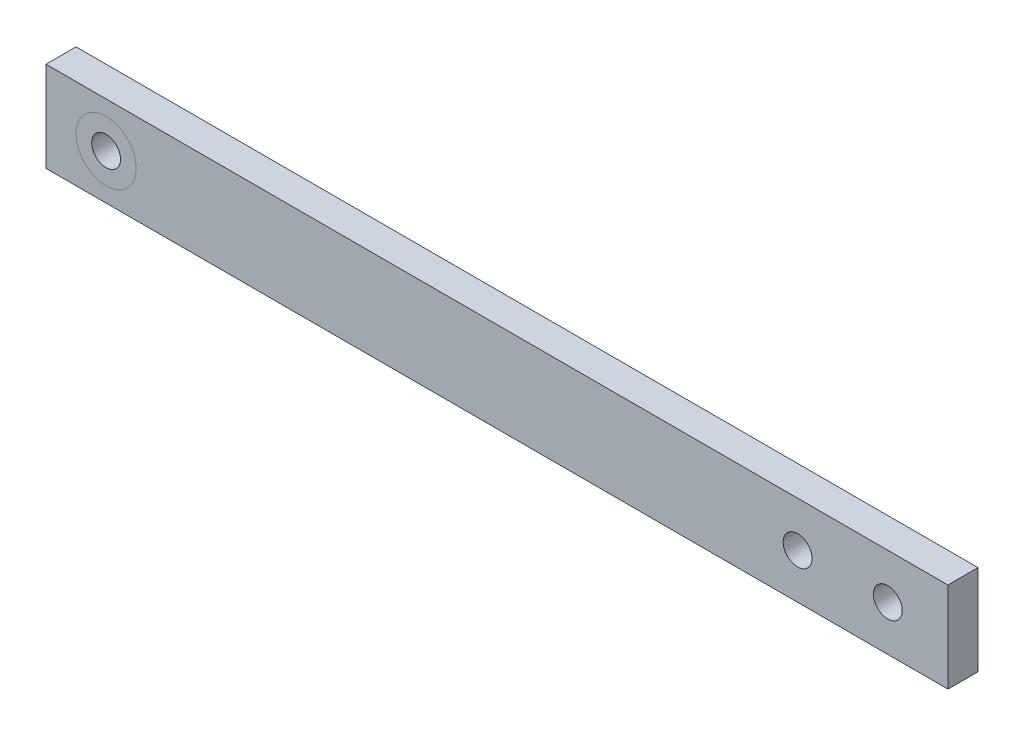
ISO-10303-21;
HEADER;
FILE_DESCRIPTION(('STEP AP214'),'2;1');
FILE_NAME('part.step','',(''),(''),'','','');
FILE_SCHEMA(('AUTOMOTIVE_DESIGN { 1 0 10303 214 1 1 1 1 }'));
ENDSEC;
DATA;
#1=APPLICATION_CONTEXT('core data for automotive mechanical design processes');
#2=APPLICATION_PROTOCOL_DEFINITION('international standard','automotive_design',2000,#1);
#3=PRODUCT_CONTEXT('',#1,'mechanical');
#4=PRODUCT('Part','Part','',(#3));
#5=PRODUCT_RELATED_PRODUCT_CATEGORY('part','',(#4));
#6=PRODUCT_DEFINITION_FORMATION('','',#4);
#7=PRODUCT_DEFINITION_CONTEXT('part definition',#1,'design');
#8=PRODUCT_DEFINITION('design','',#6,#7);
#9=PRODUCT_DEFINITION_SHAPE('','',#8);
#10=(LENGTH_UNIT() NAMED_UNIT(*) SI_UNIT(.MILLI.,.METRE.));
#11=(NAMED_UNIT(*) PLANE_ANGLE_UNIT() SI_UNIT($,.RADIAN.));
#12=(NAMED_UNIT(*) SI_UNIT($,.STERADIAN.) SOLID_ANGLE_UNIT());
#13=UNCERTAINTY_MEASURE_WITH_UNIT(LENGTH_MEASURE(1.E-05),#10,'distance_accuracy_value','');
#14=(GEOMETRIC_REPRESENTATION_CONTEXT(3) GLOBAL_UNCERTAINTY_ASSIGNED_CONTEXT((#13)) GLOBAL_UNIT_ASSIGNED_CONTEXT((#10,
#11,#12)) REPRESENTATION_CONTEXT('',''));
#15=CARTESIAN_POINT('',(0.,0.,0.));
#16=DIRECTION('',(0.,0.,1.));
#17=DIRECTION('',(1.,0.,0.));
#18=AXIS2_PLACEMENT_3D('',#15,#16,#17);
#19=CARTESIAN_POINT('',(0.,38.1,0.));
#20=DIRECTION('',(0.,0.,-1.));
#21=DIRECTION('',(-1.,0.,0.));
#22=AXIS2_PLACEMENT_3D('',#19,#20,#21);
#23=PLANE('',#22);
#24=DIRECTION('',(0.,1.,0.));
#25=VECTOR('',#24,1.);
#26=CARTESIAN_POINT('',(292.1,38.1,0.));
#27=LINE('',#26,#25);
#28=CARTESIAN_POINT('',(292.1,0.,0.));
#29=VERTEX_POINT('',#28);
#30=CARTESIAN_POINT('',(292.1,38.1,0.));
#31=VERTEX_POINT('',#30);
#32=EDGE_CURVE('E54',#29,#31,#27,.T.);
#33=ORIENTED_EDGE('',*,*,#32,.F.);
#34=DIRECTION('',(1.,0.,0.));
#35=VECTOR('',#34,1.);
#36=CARTESIAN_POINT('',(0.,0.,0.));
#37=LINE('',#36,#35);
#38=CARTESIAN_POINT('',(0.,0.,0.));
#39=VERTEX_POINT('',#38);
#40=EDGE_CURVE('E125',#39,#29,#37,.T.);
#41=ORIENTED_EDGE('',*,*,#40,.F.);
#42=DIRECTION('',(0.,-1.,0.));
#43=VECTOR('',#42,1.);
#44=CARTESIAN_POINT('',(0.,0.,0.));
#45=LINE('',#44,#43);
#46=CARTESIAN_POINT('',(0.,38.1,0.));
#47=VERTEX_POINT('',#46);
#48=EDGE_CURVE('E109',#47,#39,#45,.T.);
#49=ORIENTED_EDGE('',*,*,#48,.F.);
#50=DIRECTION('',(-1.,0.,0.));
#51=VECTOR('',#50,1.);
#52=CARTESIAN_POINT('',(0.,38.1,0.));
#53=LINE('',#52,#51);
#54=EDGE_CURVE('E122',#31,#47,#53,.T.);
#55=ORIENTED_EDGE('',*,*,#54,.F.);
#56=EDGE_LOOP('',(#33,#41,#49,#55));
#57=FACE_BOUND('',#56,.T.);
#58=CARTESIAN_POINT('',(25.4,19.05,0.));
#59=DIRECTION('',(0.,0.,-1.));
#60=DIRECTION('',(-1.,0.,0.));
#61=AXIS2_PLACEMENT_3D('',#58,#59,#60);
#62=CIRCLE('',#61,12.7);
#63=CARTESIAN_POINT('',(12.7,19.05,0.));
#64=VERTEX_POINT('',#63);
#65=EDGE_CURVE('E11',#64,#64,#62,.F.);
#66=ORIENTED_EDGE('',*,*,#65,.T.);
#67=EDGE_LOOP('',(#66));
#68=FACE_BOUND('',#67,.T.);
#69=ADVANCED_FACE('F38',(#57,#68),#23,.T.);
#70=CARTESIAN_POINT('',(0.,38.1,12.7));
#71=DIRECTION('',(0.,0.,-1.));
#72=DIRECTION('',(-1.,0.,0.));
#73=AXIS2_PLACEMENT_3D('',#70,#71,#72);
#74=PLANE('',#73);
#75=DIRECTION('',(0.,-1.,0.));
#76=VECTOR('',#75,1.);
#77=CARTESIAN_POINT('',(0.,0.,12.7));
#78=LINE('',#77,#76);
#79=CARTESIAN_POINT('',(0.,38.1,12.7));
#80=VERTEX_POINT('',#79);
#81=CARTESIAN_POINT('',(0.,0.,12.7));
#82=VERTEX_POINT('',#81);
#83=EDGE_CURVE('E96',#80,#82,#78,.T.);
#84=ORIENTED_EDGE('',*,*,#83,.T.);
#85=DIRECTION('',(1.,0.,0.));
#86=VECTOR('',#85,1.);
#87=CARTESIAN_POINT('',(0.,0.,12.7));
#88=LINE('',#87,#86);
#89=CARTESIAN_POINT('',(381.,0.,12.7));
#90=VERTEX_POINT('',#89);
#91=EDGE_CURVE('E84',#82,#90,#88,.T.);
#92=ORIENTED_EDGE('',*,*,#91,.T.);
#93=DIRECTION('',(0.,1.,0.));
#94=VECTOR('',#93,1.);
#95=CARTESIAN_POINT('',(381.,0.,12.7));
#96=LINE('',#95,#94);
#97=CARTESIAN_POINT('',(381.,38.1,12.7));
#98=VERTEX_POINT('',#97);
#99=EDGE_CURVE('E95',#90,#98,#96,.T.);
#100=ORIENTED_EDGE('',*,*,#99,.T.);
#101=DIRECTION('',(-1.,0.,0.));
#102=VECTOR('',#101,1.);
#103=CARTESIAN_POINT('',(0.,38.1,12.7));
#104=LINE('',#103,#102);
#105=EDGE_CURVE('E102',#98,#80,#104,.T.);
#106=ORIENTED_EDGE('',*,*,#105,.T.);
#107=EDGE_LOOP('',(#84,#92,#100,#106));
#108=FACE_BOUND('',#107,.T.);
#109=CARTESIAN_POINT('',(355.6,19.05,12.7));
#110=DIRECTION('',(0.,0.,1.));
#111=DIRECTION('',(1.,0.,0.));
#112=AXIS2_PLACEMENT_3D('',#109,#110,#111);
#113=CIRCLE('',#112,6.09999999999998);
#114=CARTESIAN_POINT('',(361.7,19.05,12.7));
#115=VERTEX_POINT('',#114);
#116=EDGE_CURVE('E132',#115,#115,#113,.T.);
#117=ORIENTED_EDGE('',*,*,#116,.F.);
#118=EDGE_LOOP('',(#117));
#119=FACE_BOUND('',#118,.T.);
#120=CARTESIAN_POINT('',(317.5,19.05,12.6999999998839));
#121=DIRECTION('',(0.,0.,1.));
#122=DIRECTION('',(1.,0.,0.));
#123=AXIS2_PLACEMENT_3D('',#120,#121,#122);
#124=CIRCLE('',#123,6.09999999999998);
#125=CARTESIAN_POINT('',(323.6,19.05,12.6999999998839));
#126=VERTEX_POINT('',#125);
#127=EDGE_CURVE('E138',#126,#126,#124,.T.);
#128=ORIENTED_EDGE('',*,*,#127,.F.);
#129=EDGE_LOOP('',(#128));
#130=FACE_BOUND('',#129,.T.);
#131=CARTESIAN_POINT('',(25.4,19.05,12.7));
#132=DIRECTION('',(0.,0.,-1.));
#133=DIRECTION('',(-1.,0.,0.));
#134=AXIS2_PLACEMENT_3D('',#131,#132,#133);
#135=CIRCLE('',#134,12.7);
#136=CARTESIAN_POINT('',(12.7,19.05,12.7));
#137=VERTEX_POINT('',#136);
#138=EDGE_CURVE('E42',#137,#137,#135,.F.);
#139=ORIENTED_EDGE('',*,*,#138,.F.);
#140=EDGE_LOOP('',(#139));
#141=FACE_BOUND('',#140,.T.);
#142=ADVANCED_FACE('F99',(#108,#119,#130,#141),#74,.F.);
#143=CARTESIAN_POINT('',(355.6,19.05,0.));
#144=DIRECTION('',(0.,0.,1.));
#145=DIRECTION('',(1.,0.,0.));
#146=AXIS2_PLACEMENT_3D('',#143,#144,#145);
#147=CIRCLE('',#146,6.09999999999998);
#148=CARTESIAN_POINT('',(361.7,19.05,0.));
#149=VERTEX_POINT('',#148);
#150=EDGE_CURVE('E129',#149,#149,#147,.T.);
#151=ORIENTED_EDGE('',*,*,#150,.T.);
#152=EDGE_LOOP('',(#151));
#153=FACE_BOUND('',#152,.T.);
#154=CARTESIAN_POINT('',(317.5,19.05,0.));
#155=DIRECTION('',(0.,0.,1.));
#156=DIRECTION('',(1.,0.,0.));
#157=AXIS2_PLACEMENT_3D('',#154,#155,#156);
#158=CIRCLE('',#157,6.09999999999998);
#159=CARTESIAN_POINT('',(323.6,19.05,0.));
#160=VERTEX_POINT('',#159);
#161=EDGE_CURVE('E135',#160,#160,#158,.T.);
#162=ORIENTED_EDGE('',*,*,#161,.T.);
#163=EDGE_LOOP('',(#162));
#164=FACE_BOUND('',#163,.T.);
#165=CARTESIAN_POINT('',(381.,0.,0.));
#166=VERTEX_POINT('',#165);
#167=EDGE_CURVE('E127',#29,#166,#37,.T.);
#168=ORIENTED_EDGE('',*,*,#167,.F.);
#169=ORIENTED_EDGE('',*,*,#32,.T.);
#170=CARTESIAN_POINT('',(381.,38.1,0.));
#171=VERTEX_POINT('',#170);
#172=EDGE_CURVE('E106',#171,#31,#53,.T.);
#173=ORIENTED_EDGE('',*,*,#172,.F.);
#174=DIRECTION('',(0.,1.,0.));
#175=VECTOR('',#174,1.);
#176=CARTESIAN_POINT('',(381.,0.,0.));
#177=LINE('',#176,#175);
#178=EDGE_CURVE('E123',#166,#171,#177,.T.);
#179=ORIENTED_EDGE('',*,*,#178,.F.);
#180=EDGE_LOOP('',(#168,#169,#173,#179));
#181=FACE_BOUND('',#180,.T.);
#182=ADVANCED_FACE('F171',(#153,#164,#181),#23,.T.);
#183=CARTESIAN_POINT('',(0.,0.,12.7));
#184=DIRECTION('',(1.,0.,0.));
#185=DIRECTION('',(0.,0.,-1.));
#186=AXIS2_PLACEMENT_3D('',#183,#184,#185);
#187=PLANE('',#186);
#188=ORIENTED_EDGE('',*,*,#48,.T.);
#189=DIRECTION('',(0.,0.,-1.));
#190=VECTOR('',#189,1.);
#191=CARTESIAN_POINT('',(0.,0.,12.7));
#192=LINE('',#191,#190);
#193=EDGE_CURVE('E89',#82,#39,#192,.T.);
#194=ORIENTED_EDGE('',*,*,#193,.F.);
#195=ORIENTED_EDGE('',*,*,#83,.F.);
#196=DIRECTION('',(0.,0.,-1.));
#197=VECTOR('',#196,1.);
#198=CARTESIAN_POINT('',(0.,38.1,12.7));
#199=LINE('',#198,#197);
#200=EDGE_CURVE('E118',#80,#47,#199,.T.);
#201=ORIENTED_EDGE('',*,*,#200,.T.);
#202=EDGE_LOOP('',(#188,#194,#195,#201));
#203=FACE_BOUND('',#202,.T.);
#204=ADVANCED_FACE('F40',(#203),#187,.F.);
#205=CARTESIAN_POINT('',(0.,0.,12.7));
#206=DIRECTION('',(0.,1.,0.));
#207=DIRECTION('',(0.,0.,1.));
#208=AXIS2_PLACEMENT_3D('',#205,#206,#207);
#209=PLANE('',#208);
#210=ORIENTED_EDGE('',*,*,#40,.T.);
#211=ORIENTED_EDGE('',*,*,#167,.T.);
#212=DIRECTION('',(0.,0.,-1.));
#213=VECTOR('',#212,1.);
#214=CARTESIAN_POINT('',(381.,0.,12.7));
#215=LINE('',#214,#213);
#216=EDGE_CURVE('E92',#90,#166,#215,.T.);
#217=ORIENTED_EDGE('',*,*,#216,.F.);
#218=ORIENTED_EDGE('',*,*,#91,.F.);
#219=ORIENTED_EDGE('',*,*,#193,.T.);
#220=EDGE_LOOP('',(#210,#211,#217,#218,#219));
#221=FACE_BOUND('',#220,.T.);
#222=ADVANCED_FACE('F87',(#221),#209,.F.);
#223=CARTESIAN_POINT('',(381.,0.,12.7));
#224=DIRECTION('',(-1.,0.,0.));
#225=DIRECTION('',(0.,0.,1.));
#226=AXIS2_PLACEMENT_3D('',#223,#224,#225);
#227=PLANE('',#226);
#228=ORIENTED_EDGE('',*,*,#178,.T.);
#229=DIRECTION('',(0.,0.,-1.));
#230=VECTOR('',#229,1.);
#231=CARTESIAN_POINT('',(381.,38.1,12.7));
#232=LINE('',#231,#230);
#233=EDGE_CURVE('E113',#98,#171,#232,.T.);
#234=ORIENTED_EDGE('',*,*,#233,.F.);
#235=ORIENTED_EDGE('',*,*,#99,.F.);
#236=ORIENTED_EDGE('',*,*,#216,.T.);
#237=EDGE_LOOP('',(#228,#234,#235,#236));
#238=FACE_BOUND('',#237,.T.);
#239=ADVANCED_FACE('F172',(#238),#227,.F.);
#240=CARTESIAN_POINT('',(0.,38.1,12.7));
#241=DIRECTION('',(0.,-1.,0.));
#242=DIRECTION('',(0.,0.,-1.));
#243=AXIS2_PLACEMENT_3D('',#240,#241,#242);
#244=PLANE('',#243);
#245=ORIENTED_EDGE('',*,*,#172,.T.);
#246=ORIENTED_EDGE('',*,*,#54,.T.);
#247=ORIENTED_EDGE('',*,*,#200,.F.);
#248=ORIENTED_EDGE('',*,*,#105,.F.);
#249=ORIENTED_EDGE('',*,*,#233,.T.);
#250=EDGE_LOOP('',(#245,#246,#247,#248,#249));
#251=FACE_BOUND('',#250,.T.);
#252=ADVANCED_FACE('F161',(#251),#244,.F.);
#253=ORIENTED_EDGE('',*,*,#138,.T.);
#254=EDGE_LOOP('',(#253));
#255=FACE_BOUND('',#254,.T.);
#256=CARTESIAN_POINT('',(25.4,19.05,12.7));
#257=DIRECTION('',(0.,0.,1.));
#258=DIRECTION('',(1.,0.,0.));
#259=AXIS2_PLACEMENT_3D('',#256,#257,#258);
#260=CIRCLE('',#259,6.1);
#261=CARTESIAN_POINT('',(31.5,19.05,12.7));
#262=VERTEX_POINT('',#261);
#263=EDGE_CURVE('E144',#262,#262,#260,.T.);
#264=ORIENTED_EDGE('',*,*,#263,.F.);
#265=EDGE_LOOP('',(#264));
#266=FACE_BOUND('',#265,.T.);
#267=ADVANCED_FACE('F159',(#255,#266),#74,.F.);
#268=ORIENTED_EDGE('',*,*,#65,.F.);
#269=EDGE_LOOP('',(#268));
#270=FACE_BOUND('',#269,.T.);
#271=CARTESIAN_POINT('',(25.4,19.05,0.));
#272=DIRECTION('',(0.,0.,1.));
#273=DIRECTION('',(1.,0.,0.));
#274=AXIS2_PLACEMENT_3D('',#271,#272,#273);
#275=CIRCLE('',#274,6.1);
#276=CARTESIAN_POINT('',(31.5,19.05,0.));
#277=VERTEX_POINT('',#276);
#278=EDGE_CURVE('E141',#277,#277,#275,.T.);
#279=ORIENTED_EDGE('',*,*,#278,.T.);
#280=EDGE_LOOP('',(#279));
#281=FACE_BOUND('',#280,.T.);
#282=ADVANCED_FACE('F150',(#270,#281),#23,.T.);
#283=CARTESIAN_POINT('',(355.6,19.05,0.));
#284=DIRECTION('',(0.,0.,1.));
#285=DIRECTION('',(1.,0.,0.));
#286=AXIS2_PLACEMENT_3D('',#283,#284,#285);
#287=CYLINDRICAL_SURFACE('',#286,6.09999999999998);
#288=ORIENTED_EDGE('',*,*,#150,.F.);
#289=EDGE_LOOP('',(#288));
#290=FACE_BOUND('',#289,.T.);
#291=ORIENTED_EDGE('',*,*,#116,.T.);
#292=EDGE_LOOP('',(#291));
#293=FACE_BOUND('',#292,.T.);
#294=ADVANCED_FACE('F168',(#290,#293),#287,.F.);
#295=CARTESIAN_POINT('',(317.5,19.05,0.));
#296=DIRECTION('',(0.,0.,1.));
#297=DIRECTION('',(1.,0.,0.));
#298=AXIS2_PLACEMENT_3D('',#295,#296,#297);
#299=CYLINDRICAL_SURFACE('',#298,6.09999999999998);
#300=ORIENTED_EDGE('',*,*,#161,.F.);
#301=EDGE_LOOP('',(#300));
#302=FACE_BOUND('',#301,.T.);
#303=ORIENTED_EDGE('',*,*,#127,.T.);
#304=EDGE_LOOP('',(#303));
#305=FACE_BOUND('',#304,.T.);
#306=ADVANCED_FACE('F155',(#302,#305),#299,.F.);
#307=CARTESIAN_POINT('',(25.4,19.05,0.));
#308=DIRECTION('',(0.,0.,1.));
#309=DIRECTION('',(1.,0.,0.));
#310=AXIS2_PLACEMENT_3D('',#307,#308,#309);
#311=CYLINDRICAL_SURFACE('',#310,6.1);
#312=ORIENTED_EDGE('',*,*,#278,.F.);
#313=EDGE_LOOP('',(#312));
#314=FACE_BOUND('',#313,.T.);
#315=ORIENTED_EDGE('',*,*,#263,.T.);
#316=EDGE_LOOP('',(#315));
#317=FACE_BOUND('',#316,.T.);
#318=ADVANCED_FACE('F152',(#314,#317),#311,.F.);
#319=CLOSED_SHELL('',(#69,#142,#182,#204,#222,#239,#252,#267,#282,#294,#306,#318));
#320=MANIFOLD_SOLID_BREP('B2',#319);
#321=ADVANCED_BREP_SHAPE_REPRESENTATION('',(#18,#320),#14);
#322=SHAPE_DEFINITION_REPRESENTATION(#9,#321);
ENDSEC;
END-ISO-10303-21;
